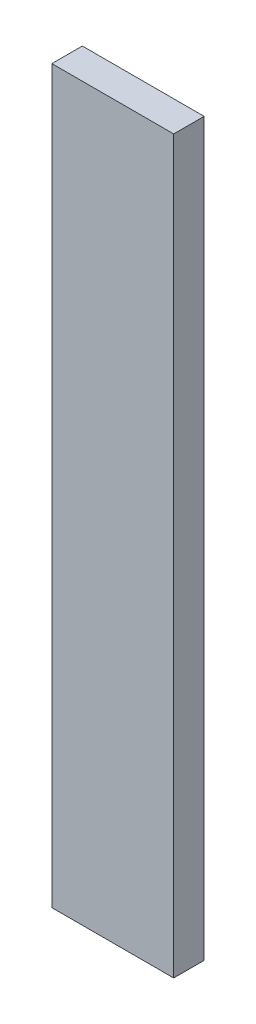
from build123d import *

# Parameters (mm, degrees)
SKETCH1_W           = 12.7
SKETCH1_H           = 76.2
BOSS_EXTRUDE1_DEPTH = 3.175


with BuildPart() as part:
    # Sketch1 → Boss-Extrude1 (new body)
    with BuildSketch(Plane.XY):
        with Locations((6.35, 38.1)):
            Rectangle(SKETCH1_W, SKETCH1_H)
    extrude(amount=BOSS_EXTRUDE1_DEPTH)


solid = part.part
